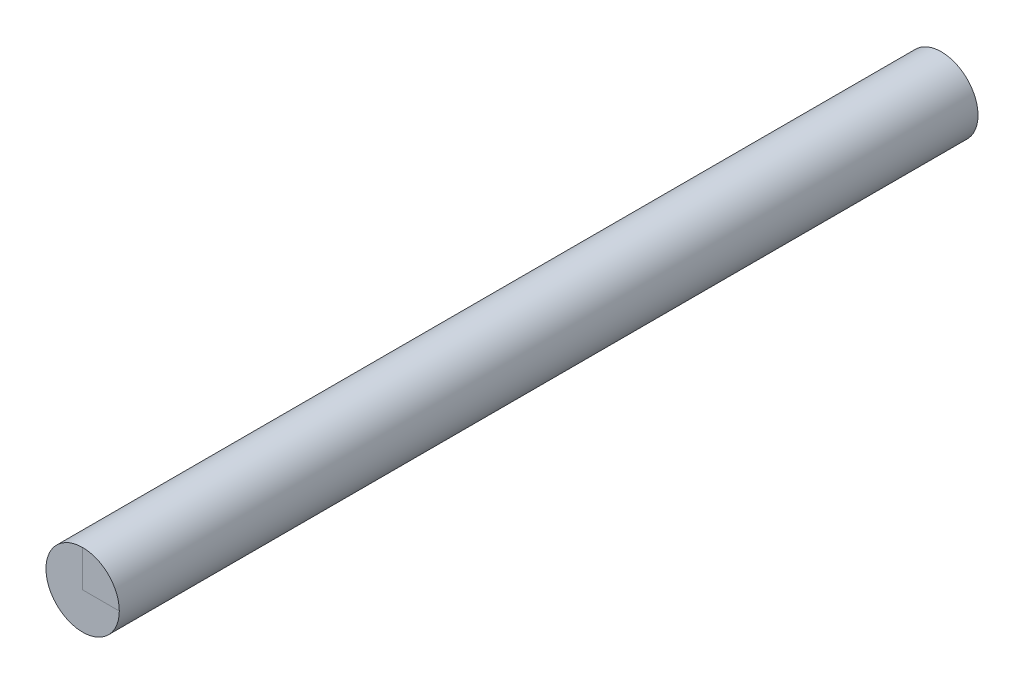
from build123d import *

# Parameters (mm, degrees)
SKETCH1_W = 15.044545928
SKETCH1_H = 352.278299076


with BuildPart() as part:
    # Sketch1 → Revolve1 (revolve)
    with BuildSketch(Plane(origin=(0, 0, 3.362376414), x_dir=(-1, 0, 0), z_dir=(0, 1, 0))):
        with Locations((-7.522272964, -179.501525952)):
            Rectangle(SKETCH1_W, SKETCH1_H)
    revolve(axis=Axis((0, 0, -238.731707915), (0, 0, 1)))


solid = part.part
